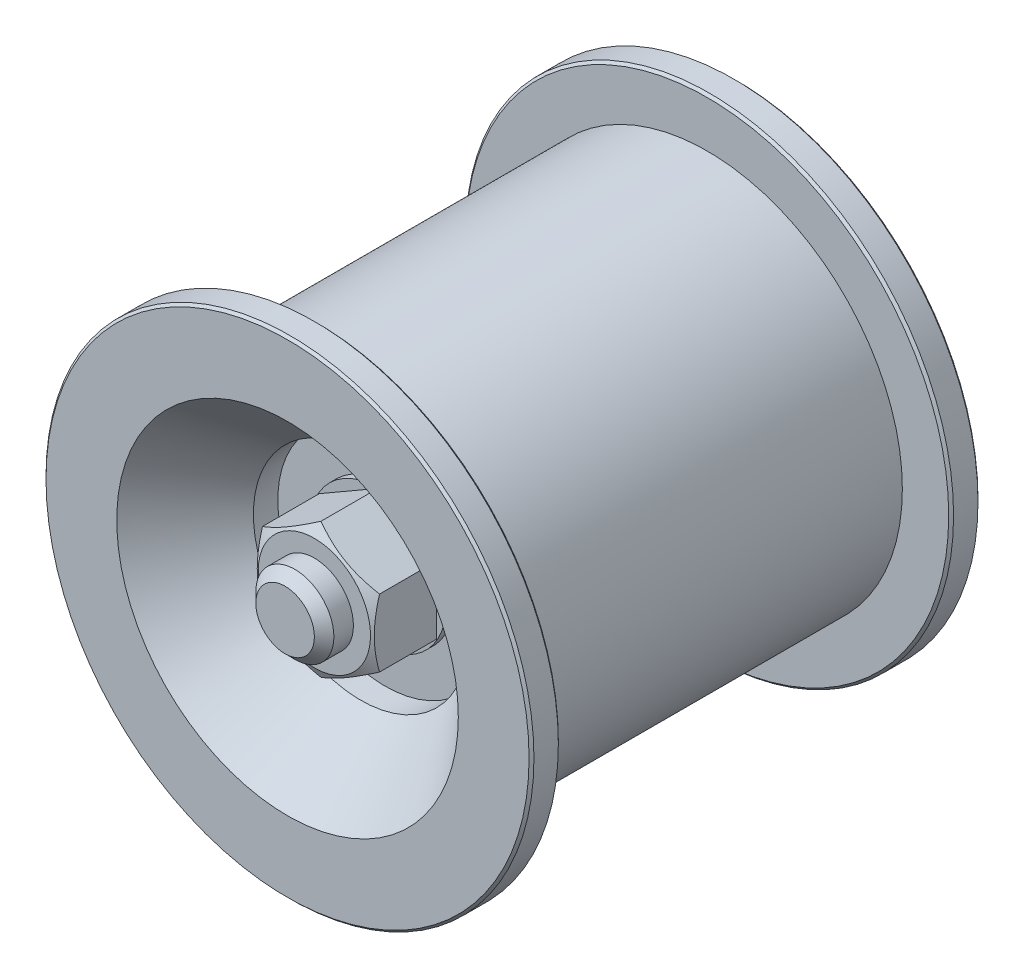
ISO-10303-21;
HEADER;
FILE_DESCRIPTION(('STEP AP214'),'2;1');
FILE_NAME('part.step','',(''),(''),'','','');
FILE_SCHEMA(('AUTOMOTIVE_DESIGN { 1 0 10303 214 1 1 1 1 }'));
ENDSEC;
DATA;
#1=APPLICATION_CONTEXT('core data for automotive mechanical design processes');
#2=APPLICATION_PROTOCOL_DEFINITION('international standard','automotive_design',2000,#1);
#3=PRODUCT_CONTEXT('',#1,'mechanical');
#4=PRODUCT('Part','Part','',(#3));
#5=PRODUCT_RELATED_PRODUCT_CATEGORY('part','',(#4));
#6=PRODUCT_DEFINITION_FORMATION('','',#4);
#7=PRODUCT_DEFINITION_CONTEXT('part definition',#1,'design');
#8=PRODUCT_DEFINITION('design','',#6,#7);
#9=PRODUCT_DEFINITION_SHAPE('','',#8);
#10=(LENGTH_UNIT() NAMED_UNIT(*) SI_UNIT(.MILLI.,.METRE.));
#11=(NAMED_UNIT(*) PLANE_ANGLE_UNIT() SI_UNIT($,.RADIAN.));
#12=(NAMED_UNIT(*) SI_UNIT($,.STERADIAN.) SOLID_ANGLE_UNIT());
#13=UNCERTAINTY_MEASURE_WITH_UNIT(LENGTH_MEASURE(1.E-05),#10,'distance_accuracy_value','');
#14=(GEOMETRIC_REPRESENTATION_CONTEXT(3) GLOBAL_UNCERTAINTY_ASSIGNED_CONTEXT((#13)) GLOBAL_UNIT_ASSIGNED_CONTEXT((#10,
#11,#12)) REPRESENTATION_CONTEXT('',''));
#15=CARTESIAN_POINT('',(0.,0.,0.));
#16=DIRECTION('',(0.,0.,1.));
#17=DIRECTION('',(1.,0.,0.));
#18=AXIS2_PLACEMENT_3D('',#15,#16,#17);
#19=CARTESIAN_POINT('',(0.,-10.,74.));
#20=DIRECTION('',(0.,0.,-1.));
#21=DIRECTION('',(1.,0.,0.));
#22=AXIS2_PLACEMENT_3D('',#19,#20,#21);
#23=PLANE('',#22);
#24=CARTESIAN_POINT('',(0.,0.,74.));
#25=DIRECTION('',(0.,0.,-1.));
#26=DIRECTION('',(1.,0.,0.));
#27=AXIS2_PLACEMENT_3D('',#24,#25,#26);
#28=CIRCLE('',#27,22.);
#29=CARTESIAN_POINT('',(22.,0.,74.));
#30=VERTEX_POINT('',#29);
#31=EDGE_CURVE('E151',#30,#30,#28,.T.);
#32=ORIENTED_EDGE('',*,*,#31,.F.);
#33=EDGE_LOOP('',(#32));
#34=FACE_BOUND('',#33,.T.);
#35=CARTESIAN_POINT('',(0.,0.,74.));
#36=DIRECTION('',(0.,0.,1.));
#37=DIRECTION('',(1.,0.,0.));
#38=AXIS2_PLACEMENT_3D('',#35,#36,#37);
#39=CIRCLE('',#38,14.);
#40=CARTESIAN_POINT('',(14.,0.,74.));
#41=VERTEX_POINT('',#40);
#42=EDGE_CURVE('E136',#41,#41,#39,.T.);
#43=ORIENTED_EDGE('',*,*,#42,.F.);
#44=EDGE_LOOP('',(#43));
#45=FACE_BOUND('',#44,.T.);
#46=ADVANCED_FACE('F15',(#34,#45),#23,.F.);
#47=CARTESIAN_POINT('',(0.,0.,28.0000000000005));
#48=DIRECTION('',(0.,0.,-1.));
#49=DIRECTION('',(1.,0.,0.));
#50=AXIS2_PLACEMENT_3D('',#47,#48,#49);
#51=CYLINDRICAL_SURFACE('',#50,22.);
#52=CARTESIAN_POINT('',(0.,0.,79.));
#53=DIRECTION('',(0.,0.,-1.));
#54=DIRECTION('',(1.,0.,0.));
#55=AXIS2_PLACEMENT_3D('',#52,#53,#54);
#56=CIRCLE('',#55,22.);
#57=CARTESIAN_POINT('',(22.,0.,79.));
#58=VERTEX_POINT('',#57);
#59=EDGE_CURVE('E205',#58,#58,#56,.T.);
#60=ORIENTED_EDGE('',*,*,#59,.F.);
#61=EDGE_LOOP('',(#60));
#62=FACE_BOUND('',#61,.T.);
#63=ORIENTED_EDGE('',*,*,#31,.T.);
#64=EDGE_LOOP('',(#63));
#65=FACE_BOUND('',#64,.T.);
#66=ADVANCED_FACE('F380',(#62,#65),#51,.F.);
#67=CARTESIAN_POINT('',(0.,0.,79.));
#68=DIRECTION('',(0.,0.,1.));
#69=DIRECTION('',(-1.,0.,0.));
#70=AXIS2_PLACEMENT_3D('',#67,#68,#69);
#71=CONICAL_SURFACE('',#70,22.,0.714090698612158);
#72=CARTESIAN_POINT('',(0.,0.,94.));
#73=DIRECTION('',(0.,0.,-1.));
#74=DIRECTION('',(1.,0.,0.));
#75=AXIS2_PLACEMENT_3D('',#72,#73,#74);
#76=CIRCLE('',#75,35.);
#77=CARTESIAN_POINT('',(35.,0.,94.));
#78=VERTEX_POINT('',#77);
#79=EDGE_CURVE('E202',#78,#78,#76,.T.);
#80=ORIENTED_EDGE('',*,*,#79,.F.);
#81=EDGE_LOOP('',(#80));
#82=FACE_BOUND('',#81,.T.);
#83=ORIENTED_EDGE('',*,*,#59,.T.);
#84=EDGE_LOOP('',(#83));
#85=FACE_BOUND('',#84,.T.);
#86=ADVANCED_FACE('F376',(#82,#85),#71,.F.);
#87=CARTESIAN_POINT('',(0.,-50.,94.));
#88=DIRECTION('',(0.,0.,1.));
#89=DIRECTION('',(-1.,0.,0.));
#90=AXIS2_PLACEMENT_3D('',#87,#88,#89);
#91=PLANE('',#90);
#92=CARTESIAN_POINT('',(0.,0.,94.));
#93=DIRECTION('',(0.,0.,1.));
#94=DIRECTION('',(1.,0.,0.));
#95=AXIS2_PLACEMENT_3D('',#92,#93,#94);
#96=CIRCLE('',#95,49.5);
#97=CARTESIAN_POINT('',(49.5,0.,94.));
#98=VERTEX_POINT('',#97);
#99=EDGE_CURVE('E23',#98,#98,#96,.T.);
#100=ORIENTED_EDGE('',*,*,#99,.T.);
#101=EDGE_LOOP('',(#100));
#102=FACE_BOUND('',#101,.T.);
#103=ORIENTED_EDGE('',*,*,#79,.T.);
#104=EDGE_LOOP('',(#103));
#105=FACE_BOUND('',#104,.T.);
#106=ADVANCED_FACE('F372',(#102,#105),#91,.T.);
#107=CARTESIAN_POINT('',(0.,0.,28.0000000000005));
#108=DIRECTION('',(0.,0.,-1.));
#109=DIRECTION('',(1.,0.,0.));
#110=AXIS2_PLACEMENT_3D('',#107,#108,#109);
#111=CYLINDRICAL_SURFACE('',#110,50.);
#112=CARTESIAN_POINT('',(0.,0.,93.5));
#113=DIRECTION('',(0.,0.,1.));
#114=DIRECTION('',(1.,0.,0.));
#115=AXIS2_PLACEMENT_3D('',#112,#113,#114);
#116=CIRCLE('',#115,50.);
#117=CARTESIAN_POINT('',(50.,0.,93.5));
#118=VERTEX_POINT('',#117);
#119=EDGE_CURVE('E422',#118,#118,#116,.F.);
#120=ORIENTED_EDGE('',*,*,#119,.T.);
#121=EDGE_LOOP('',(#120));
#122=FACE_BOUND('',#121,.T.);
#123=CARTESIAN_POINT('',(0.,0.,88.5));
#124=DIRECTION('',(0.,0.,1.));
#125=DIRECTION('',(1.,0.,0.));
#126=AXIS2_PLACEMENT_3D('',#123,#124,#125);
#127=CIRCLE('',#126,50.);
#128=CARTESIAN_POINT('',(50.,0.,88.5));
#129=VERTEX_POINT('',#128);
#130=EDGE_CURVE('E423',#129,#129,#127,.T.);
#131=ORIENTED_EDGE('',*,*,#130,.T.);
#132=EDGE_LOOP('',(#131));
#133=FACE_BOUND('',#132,.T.);
#134=ADVANCED_FACE('F368',(#122,#133),#111,.T.);
#135=CARTESIAN_POINT('',(0.,-50.,88.));
#136=DIRECTION('',(0.,0.,1.));
#137=DIRECTION('',(-1.,0.,0.));
#138=AXIS2_PLACEMENT_3D('',#135,#136,#137);
#139=PLANE('',#138);
#140=CARTESIAN_POINT('',(0.,0.,88.));
#141=DIRECTION('',(0.,0.,1.));
#142=DIRECTION('',(1.,0.,0.));
#143=AXIS2_PLACEMENT_3D('',#140,#141,#142);
#144=CIRCLE('',#143,49.5);
#145=CARTESIAN_POINT('',(49.5,0.,88.));
#146=VERTEX_POINT('',#145);
#147=EDGE_CURVE('E9',#146,#146,#144,.F.);
#148=ORIENTED_EDGE('',*,*,#147,.T.);
#149=EDGE_LOOP('',(#148));
#150=FACE_BOUND('',#149,.T.);
#151=CARTESIAN_POINT('',(0.,0.,88.));
#152=DIRECTION('',(0.,0.,-1.));
#153=DIRECTION('',(1.,0.,0.));
#154=AXIS2_PLACEMENT_3D('',#151,#152,#153);
#155=CIRCLE('',#154,40.);
#156=CARTESIAN_POINT('',(40.,0.,88.));
#157=VERTEX_POINT('',#156);
#158=EDGE_CURVE('E199',#157,#157,#155,.T.);
#159=ORIENTED_EDGE('',*,*,#158,.F.);
#160=EDGE_LOOP('',(#159));
#161=FACE_BOUND('',#160,.T.);
#162=ADVANCED_FACE('F364',(#150,#161),#139,.F.);
#163=CARTESIAN_POINT('',(0.,0.,28.0000000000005));
#164=DIRECTION('',(0.,0.,-1.));
#165=DIRECTION('',(1.,0.,0.));
#166=AXIS2_PLACEMENT_3D('',#163,#164,#165);
#167=CYLINDRICAL_SURFACE('',#166,40.);
#168=ORIENTED_EDGE('',*,*,#158,.T.);
#169=EDGE_LOOP('',(#168));
#170=FACE_BOUND('',#169,.T.);
#171=CARTESIAN_POINT('',(0.,0.,8.00000000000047));
#172=DIRECTION('',(0.,0.,-1.));
#173=DIRECTION('',(1.,0.,0.));
#174=AXIS2_PLACEMENT_3D('',#171,#172,#173);
#175=CIRCLE('',#174,40.);
#176=CARTESIAN_POINT('',(40.,0.,8.00000000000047));
#177=VERTEX_POINT('',#176);
#178=EDGE_CURVE('E196',#177,#177,#175,.T.);
#179=ORIENTED_EDGE('',*,*,#178,.F.);
#180=EDGE_LOOP('',(#179));
#181=FACE_BOUND('',#180,.T.);
#182=ADVANCED_FACE('F360',(#170,#181),#167,.T.);
#183=CARTESIAN_POINT('',(0.,-50.,8.00000000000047));
#184=DIRECTION('',(0.,0.,1.));
#185=DIRECTION('',(-1.,0.,0.));
#186=AXIS2_PLACEMENT_3D('',#183,#184,#185);
#187=PLANE('',#186);
#188=CARTESIAN_POINT('',(0.,0.,8.00000000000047));
#189=DIRECTION('',(0.,0.,1.));
#190=DIRECTION('',(1.,0.,0.));
#191=AXIS2_PLACEMENT_3D('',#188,#189,#190);
#192=CIRCLE('',#191,49.5);
#193=CARTESIAN_POINT('',(49.5,0.,8.00000000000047));
#194=VERTEX_POINT('',#193);
#195=EDGE_CURVE('E426',#194,#194,#192,.T.);
#196=ORIENTED_EDGE('',*,*,#195,.T.);
#197=EDGE_LOOP('',(#196));
#198=FACE_BOUND('',#197,.T.);
#199=ORIENTED_EDGE('',*,*,#178,.T.);
#200=EDGE_LOOP('',(#199));
#201=FACE_BOUND('',#200,.T.);
#202=ADVANCED_FACE('F356',(#198,#201),#187,.T.);
#203=CARTESIAN_POINT('',(0.,0.,28.0000000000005));
#204=DIRECTION('',(0.,0.,-1.));
#205=DIRECTION('',(1.,0.,0.));
#206=AXIS2_PLACEMENT_3D('',#203,#204,#205);
#207=CYLINDRICAL_SURFACE('',#206,50.);
#208=CARTESIAN_POINT('',(0.,0.,2.50000000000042));
#209=DIRECTION('',(0.,0.,1.));
#210=DIRECTION('',(1.,0.,0.));
#211=AXIS2_PLACEMENT_3D('',#208,#209,#210);
#212=CIRCLE('',#211,50.);
#213=CARTESIAN_POINT('',(50.,0.,2.50000000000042));
#214=VERTEX_POINT('',#213);
#215=EDGE_CURVE('E431',#214,#214,#212,.T.);
#216=ORIENTED_EDGE('',*,*,#215,.T.);
#217=EDGE_LOOP('',(#216));
#218=FACE_BOUND('',#217,.T.);
#219=CARTESIAN_POINT('',(0.,0.,7.50000000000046));
#220=DIRECTION('',(0.,0.,1.));
#221=DIRECTION('',(1.,0.,0.));
#222=AXIS2_PLACEMENT_3D('',#219,#220,#221);
#223=CIRCLE('',#222,50.);
#224=CARTESIAN_POINT('',(50.,0.,7.50000000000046));
#225=VERTEX_POINT('',#224);
#226=EDGE_CURVE('E433',#225,#225,#223,.F.);
#227=ORIENTED_EDGE('',*,*,#226,.T.);
#228=EDGE_LOOP('',(#227));
#229=FACE_BOUND('',#228,.T.);
#230=ADVANCED_FACE('F352',(#218,#229),#207,.T.);
#231=CARTESIAN_POINT('',(0.,-50.,2.00000000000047));
#232=DIRECTION('',(0.,0.,1.));
#233=DIRECTION('',(-1.,0.,0.));
#234=AXIS2_PLACEMENT_3D('',#231,#232,#233);
#235=PLANE('',#234);
#236=CARTESIAN_POINT('',(0.,0.,2.00000000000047));
#237=DIRECTION('',(0.,0.,1.));
#238=DIRECTION('',(1.,0.,0.));
#239=AXIS2_PLACEMENT_3D('',#236,#237,#238);
#240=CIRCLE('',#239,49.5);
#241=CARTESIAN_POINT('',(49.5,0.,2.00000000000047));
#242=VERTEX_POINT('',#241);
#243=EDGE_CURVE('E229',#242,#242,#240,.F.);
#244=ORIENTED_EDGE('',*,*,#243,.T.);
#245=EDGE_LOOP('',(#244));
#246=FACE_BOUND('',#245,.T.);
#247=CARTESIAN_POINT('',(0.,0.,2.00000000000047));
#248=DIRECTION('',(0.,0.,-1.));
#249=DIRECTION('',(1.,0.,0.));
#250=AXIS2_PLACEMENT_3D('',#247,#248,#249);
#251=CIRCLE('',#250,35.);
#252=CARTESIAN_POINT('',(35.,0.,2.00000000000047));
#253=VERTEX_POINT('',#252);
#254=EDGE_CURVE('E193',#253,#253,#251,.T.);
#255=ORIENTED_EDGE('',*,*,#254,.F.);
#256=EDGE_LOOP('',(#255));
#257=FACE_BOUND('',#256,.T.);
#258=ADVANCED_FACE('F348',(#246,#257),#235,.F.);
#259=CARTESIAN_POINT('',(0.,0.,17.0000000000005));
#260=DIRECTION('',(0.,0.,-1.));
#261=DIRECTION('',(1.,0.,0.));
#262=AXIS2_PLACEMENT_3D('',#259,#260,#261);
#263=CONICAL_SURFACE('',#262,22.,0.714090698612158);
#264=ORIENTED_EDGE('',*,*,#254,.T.);
#265=EDGE_LOOP('',(#264));
#266=FACE_BOUND('',#265,.T.);
#267=CARTESIAN_POINT('',(0.,0.,17.0000000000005));
#268=DIRECTION('',(0.,0.,-1.));
#269=DIRECTION('',(1.,0.,0.));
#270=AXIS2_PLACEMENT_3D('',#267,#268,#269);
#271=CIRCLE('',#270,22.);
#272=CARTESIAN_POINT('',(22.,0.,17.0000000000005));
#273=VERTEX_POINT('',#272);
#274=EDGE_CURVE('E189',#273,#273,#271,.T.);
#275=ORIENTED_EDGE('',*,*,#274,.F.);
#276=EDGE_LOOP('',(#275));
#277=FACE_BOUND('',#276,.T.);
#278=ADVANCED_FACE('F344',(#266,#277),#263,.F.);
#279=CARTESIAN_POINT('',(0.,0.,28.0000000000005));
#280=DIRECTION('',(0.,0.,-1.));
#281=DIRECTION('',(1.,0.,0.));
#282=AXIS2_PLACEMENT_3D('',#279,#280,#281);
#283=CYLINDRICAL_SURFACE('',#282,22.);
#284=ORIENTED_EDGE('',*,*,#274,.T.);
#285=EDGE_LOOP('',(#284));
#286=FACE_BOUND('',#285,.T.);
#287=CARTESIAN_POINT('',(0.,0.,22.0000000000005));
#288=DIRECTION('',(0.,0.,-1.));
#289=DIRECTION('',(1.,0.,0.));
#290=AXIS2_PLACEMENT_3D('',#287,#288,#289);
#291=CIRCLE('',#290,22.);
#292=CARTESIAN_POINT('',(22.,0.,22.0000000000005));
#293=VERTEX_POINT('',#292);
#294=EDGE_CURVE('E186',#293,#293,#291,.T.);
#295=ORIENTED_EDGE('',*,*,#294,.F.);
#296=EDGE_LOOP('',(#295));
#297=FACE_BOUND('',#296,.T.);
#298=ADVANCED_FACE('F341',(#286,#297),#283,.F.);
#299=CARTESIAN_POINT('',(0.,-10.,22.0000000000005));
#300=DIRECTION('',(0.,0.,-1.));
#301=DIRECTION('',(1.,0.,0.));
#302=AXIS2_PLACEMENT_3D('',#299,#300,#301);
#303=PLANE('',#302);
#304=DIRECTION('',(0.,-1.,0.));
#305=VECTOR('',#304,1.);
#306=CARTESIAN_POINT('',(11.,11.6189500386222,22.));
#307=LINE('',#306,#305);
#308=CARTESIAN_POINT('',(11.,11.6189500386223,22.));
#309=VERTEX_POINT('',#308);
#310=CARTESIAN_POINT('',(11.,-11.6189500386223,22.));
#311=VERTEX_POINT('',#310);
#312=EDGE_CURVE('E159',#309,#311,#307,.T.);
#313=ORIENTED_EDGE('',*,*,#312,.F.);
#314=CARTESIAN_POINT('',(0.,0.,22.));
#315=DIRECTION('',(0.,0.,1.));
#316=DIRECTION('',(1.,0.,0.));
#317=AXIS2_PLACEMENT_3D('',#314,#315,#316);
#318=CIRCLE('',#317,16.);
#319=CARTESIAN_POINT('',(-11.,11.6189500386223,22.));
#320=VERTEX_POINT('',#319);
#321=EDGE_CURVE('E181',#309,#320,#318,.T.);
#322=ORIENTED_EDGE('',*,*,#321,.T.);
#323=DIRECTION('',(0.,-1.,0.));
#324=VECTOR('',#323,1.);
#325=CARTESIAN_POINT('',(-11.,11.6189500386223,22.));
#326=LINE('',#325,#324);
#327=CARTESIAN_POINT('',(-11.,-11.6189500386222,22.));
#328=VERTEX_POINT('',#327);
#329=EDGE_CURVE('E148',#320,#328,#326,.T.);
#330=ORIENTED_EDGE('',*,*,#329,.T.);
#331=EDGE_CURVE('E74',#328,#311,#318,.T.);
#332=ORIENTED_EDGE('',*,*,#331,.T.);
#333=EDGE_LOOP('',(#313,#322,#330,#332));
#334=FACE_BOUND('',#333,.T.);
#335=ORIENTED_EDGE('',*,*,#294,.T.);
#336=EDGE_LOOP('',(#335));
#337=FACE_BOUND('',#336,.T.);
#338=ADVANCED_FACE('F312',(#334,#337),#303,.T.);
#339=CARTESIAN_POINT('',(11.,11.6189500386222,-22.5));
#340=DIRECTION('',(-1.,0.,0.));
#341=DIRECTION('',(0.,0.,1.));
#342=AXIS2_PLACEMENT_3D('',#339,#340,#341);
#343=PLANE('',#342);
#344=DIRECTION('',(0.,0.,1.));
#345=VECTOR('',#344,1.);
#346=CARTESIAN_POINT('',(11.,11.6189500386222,-22.5));
#347=LINE('',#346,#345);
#348=CARTESIAN_POINT('',(11.,11.6189500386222,0.));
#349=VERTEX_POINT('',#348);
#350=EDGE_CURVE('E161',#349,#309,#347,.T.);
#351=ORIENTED_EDGE('',*,*,#350,.T.);
#352=ORIENTED_EDGE('',*,*,#312,.T.);
#353=DIRECTION('',(0.,0.,1.));
#354=VECTOR('',#353,1.);
#355=CARTESIAN_POINT('',(11.,-11.6189500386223,-22.5));
#356=LINE('',#355,#354);
#357=CARTESIAN_POINT('',(11.,-11.6189500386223,0.));
#358=VERTEX_POINT('',#357);
#359=EDGE_CURVE('E164',#358,#311,#356,.T.);
#360=ORIENTED_EDGE('',*,*,#359,.F.);
#361=DIRECTION('',(0.,-1.,0.));
#362=VECTOR('',#361,1.);
#363=CARTESIAN_POINT('',(11.,0.,0.));
#364=LINE('',#363,#362);
#365=EDGE_CURVE('E166',#349,#358,#364,.T.);
#366=ORIENTED_EDGE('',*,*,#365,.F.);
#367=EDGE_LOOP('',(#351,#352,#360,#366));
#368=FACE_BOUND('',#367,.T.);
#369=ADVANCED_FACE('F309',(#368),#343,.F.);
#370=CARTESIAN_POINT('',(0.,0.,22.));
#371=DIRECTION('',(0.,0.,-1.));
#372=DIRECTION('',(-1.,0.,0.));
#373=AXIS2_PLACEMENT_3D('',#370,#371,#372);
#374=CYLINDRICAL_SURFACE('',#373,16.);
#375=DIRECTION('',(0.,0.,1.));
#376=VECTOR('',#375,1.);
#377=CARTESIAN_POINT('',(-11.,11.6189500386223,-22.5));
#378=LINE('',#377,#376);
#379=CARTESIAN_POINT('',(-11.,11.6189500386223,0.));
#380=VERTEX_POINT('',#379);
#381=EDGE_CURVE('E154',#380,#320,#378,.T.);
#382=ORIENTED_EDGE('',*,*,#381,.T.);
#383=ORIENTED_EDGE('',*,*,#321,.F.);
#384=ORIENTED_EDGE('',*,*,#350,.F.);
#385=CARTESIAN_POINT('',(0.,0.,0.));
#386=DIRECTION('',(0.,0.,1.));
#387=DIRECTION('',(1.,0.,0.));
#388=AXIS2_PLACEMENT_3D('',#385,#386,#387);
#389=CIRCLE('',#388,16.);
#390=EDGE_CURVE('E178',#349,#380,#389,.T.);
#391=ORIENTED_EDGE('',*,*,#390,.T.);
#392=EDGE_LOOP('',(#382,#383,#384,#391));
#393=FACE_BOUND('',#392,.T.);
#394=ADVANCED_FACE('F306',(#393),#374,.T.);
#395=CARTESIAN_POINT('',(-11.,11.6189500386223,-22.5));
#396=DIRECTION('',(-1.,0.,0.));
#397=DIRECTION('',(0.,-1.,0.));
#398=AXIS2_PLACEMENT_3D('',#395,#396,#397);
#399=PLANE('',#398);
#400=DIRECTION('',(0.,-1.,0.));
#401=VECTOR('',#400,1.);
#402=CARTESIAN_POINT('',(-11.,0.,0.));
#403=LINE('',#402,#401);
#404=CARTESIAN_POINT('',(-11.,-11.6189500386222,0.));
#405=VERTEX_POINT('',#404);
#406=EDGE_CURVE('E157',#380,#405,#403,.T.);
#407=ORIENTED_EDGE('',*,*,#406,.T.);
#408=DIRECTION('',(0.,0.,1.));
#409=VECTOR('',#408,1.);
#410=CARTESIAN_POINT('',(-11.,-11.6189500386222,-22.5));
#411=LINE('',#410,#409);
#412=EDGE_CURVE('E150',#405,#328,#411,.T.);
#413=ORIENTED_EDGE('',*,*,#412,.T.);
#414=ORIENTED_EDGE('',*,*,#329,.F.);
#415=ORIENTED_EDGE('',*,*,#381,.F.);
#416=EDGE_LOOP('',(#407,#413,#414,#415));
#417=FACE_BOUND('',#416,.T.);
#418=ADVANCED_FACE('F302',(#417),#399,.T.);
#419=ORIENTED_EDGE('',*,*,#412,.F.);
#420=EDGE_CURVE('E177',#405,#358,#389,.T.);
#421=ORIENTED_EDGE('',*,*,#420,.T.);
#422=ORIENTED_EDGE('',*,*,#359,.T.);
#423=ORIENTED_EDGE('',*,*,#331,.F.);
#424=EDGE_LOOP('',(#419,#421,#422,#423));
#425=FACE_BOUND('',#424,.T.);
#426=ADVANCED_FACE('F305',(#425),#374,.T.);
#427=CARTESIAN_POINT('',(0.,0.,0.));
#428=DIRECTION('',(0.,0.,1.));
#429=DIRECTION('',(1.,0.,0.));
#430=AXIS2_PLACEMENT_3D('',#427,#428,#429);
#431=PLANE('',#430);
#432=CARTESIAN_POINT('',(0.,0.,0.));
#433=DIRECTION('',(0.,0.,1.));
#434=DIRECTION('',(1.,0.,0.));
#435=AXIS2_PLACEMENT_3D('',#432,#433,#434);
#436=CIRCLE('',#435,10.);
#437=CARTESIAN_POINT('',(10.,0.,0.));
#438=VERTEX_POINT('',#437);
#439=EDGE_CURVE('E174',#438,#438,#436,.T.);
#440=ORIENTED_EDGE('',*,*,#439,.T.);
#441=EDGE_LOOP('',(#440));
#442=FACE_BOUND('',#441,.T.);
#443=ORIENTED_EDGE('',*,*,#406,.F.);
#444=ORIENTED_EDGE('',*,*,#390,.F.);
#445=ORIENTED_EDGE('',*,*,#365,.T.);
#446=ORIENTED_EDGE('',*,*,#420,.F.);
#447=EDGE_LOOP('',(#443,#444,#445,#446));
#448=FACE_BOUND('',#447,.T.);
#449=ADVANCED_FACE('F308',(#442,#448),#431,.F.);
#450=CARTESIAN_POINT('',(0.,0.,0.));
#451=DIRECTION('',(0.,0.,-1.));
#452=DIRECTION('',(-1.,0.,0.));
#453=AXIS2_PLACEMENT_3D('',#450,#451,#452);
#454=CYLINDRICAL_SURFACE('',#453,10.);
#455=CARTESIAN_POINT('',(0.,0.,-20.));
#456=DIRECTION('',(0.,0.,1.));
#457=DIRECTION('',(1.,0.,0.));
#458=AXIS2_PLACEMENT_3D('',#455,#456,#457);
#459=CIRCLE('',#458,10.);
#460=CARTESIAN_POINT('',(10.,0.,-20.));
#461=VERTEX_POINT('',#460);
#462=EDGE_CURVE('E147',#461,#461,#459,.T.);
#463=ORIENTED_EDGE('',*,*,#462,.T.);
#464=EDGE_LOOP('',(#463));
#465=FACE_BOUND('',#464,.T.);
#466=ORIENTED_EDGE('',*,*,#439,.F.);
#467=EDGE_LOOP('',(#466));
#468=FACE_BOUND('',#467,.T.);
#469=ADVANCED_FACE('F329',(#465,#468),#454,.T.);
#470=CARTESIAN_POINT('',(0.,0.,-22.5));
#471=DIRECTION('',(0.,0.,1.));
#472=DIRECTION('',(1.,0.,0.));
#473=AXIS2_PLACEMENT_3D('',#470,#471,#472);
#474=PLANE('',#473);
#475=CARTESIAN_POINT('',(0.,0.,-22.5));
#476=DIRECTION('',(0.,0.,1.));
#477=DIRECTION('',(1.,0.,0.));
#478=AXIS2_PLACEMENT_3D('',#475,#476,#477);
#479=CIRCLE('',#478,7.5);
#480=CARTESIAN_POINT('',(7.5,0.,-22.5));
#481=VERTEX_POINT('',#480);
#482=EDGE_CURVE('E212',#481,#481,#479,.F.);
#483=ORIENTED_EDGE('',*,*,#482,.T.);
#484=EDGE_LOOP('',(#483));
#485=FACE_BOUND('',#484,.T.);
#486=ADVANCED_FACE('F334',(#485),#474,.F.);
#487=CARTESIAN_POINT('',(11.9944518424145,6.925,88.5));
#488=DIRECTION('',(-0.5,-0.866025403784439,0.));
#489=DIRECTION('',(0.866025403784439,-0.5,0.));
#490=AXIS2_PLACEMENT_3D('',#487,#488,#489);
#491=PLANE('',#490);
#492=DIRECTION('',(0.,0.,-1.));
#493=VECTOR('',#492,1.);
#494=CARTESIAN_POINT('',(0.,13.85,88.5));
#495=LINE('',#494,#493);
#496=CARTESIAN_POINT('',(0.,13.85,87.1432268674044));
#497=VERTEX_POINT('',#496);
#498=CARTESIAN_POINT('',(0.,13.85,75.5));
#499=VERTEX_POINT('',#498);
#500=EDGE_CURVE('E130',#497,#499,#495,.T.);
#501=ORIENTED_EDGE('',*,*,#500,.F.);
#502=CARTESIAN_POINT('',(-0.0002,13.8501154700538,87.143160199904));
#503=CARTESIAN_POINT('',(0.263463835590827,13.6978890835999,87.2310333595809));
#504=CARTESIAN_POINT('',(0.52811074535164,13.5450951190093,87.3149181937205));
#505=CARTESIAN_POINT('',(1.05952683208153,13.2382818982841,87.4736045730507));
#506=CARTESIAN_POINT('',(1.32629667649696,13.0842622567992,87.548403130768));
#507=CARTESIAN_POINT('',(2.13090464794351,12.6197216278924,87.7577218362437));
#508=CARTESIAN_POINT('',(2.67191906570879,12.3073668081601,87.876781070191));
#509=CARTESIAN_POINT('',(3.4815223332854,11.839942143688,88.0163886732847));
#510=CARTESIAN_POINT('',(3.74769248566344,11.6862687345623,88.0561575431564));
#511=CARTESIAN_POINT('',(4.2812651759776,11.3782103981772,88.1228471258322));
#512=CARTESIAN_POINT('',(4.54866773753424,11.2238254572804,88.1497675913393));
#513=CARTESIAN_POINT('',(5.0839186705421,10.9147981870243,88.1900708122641));
#514=CARTESIAN_POINT('',(5.35176613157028,10.760156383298,88.203469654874));
#515=CARTESIAN_POINT('',(5.8877092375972,10.450729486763,88.2164441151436));
#516=CARTESIAN_POINT('',(6.15580487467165,10.2959443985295,88.2160201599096));
#517=CARTESIAN_POINT('',(6.657010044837,10.0065734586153,88.2023137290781));
#518=CARTESIAN_POINT('',(6.89015532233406,9.87196696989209,88.1907031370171));
#519=CARTESIAN_POINT('',(7.35590964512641,9.60306358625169,88.1572465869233));
#520=CARTESIAN_POINT('',(7.58851865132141,9.46876671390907,88.1353999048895));
#521=CARTESIAN_POINT('',(8.05307401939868,9.20055554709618,88.0818520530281));
#522=CARTESIAN_POINT('',(8.28501967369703,9.06664166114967,88.050142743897));
#523=CARTESIAN_POINT('',(8.74782356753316,8.79944170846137,87.9774259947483));
#524=CARTESIAN_POINT('',(8.97868173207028,8.66615568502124,87.9364179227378));
#525=CARTESIAN_POINT('',(9.6794646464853,8.26155848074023,87.7984089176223));
#526=CARTESIAN_POINT('',(10.1473600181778,7.99141896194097,87.6876469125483));
#527=CARTESIAN_POINT('',(11.076173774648,7.4551680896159,87.4362623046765));
#528=CARTESIAN_POINT('',(11.537104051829,7.18904987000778,87.2956987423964));
#529=CARTESIAN_POINT('',(11.9946518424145,6.92488452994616,87.143160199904));
#530=B_SPLINE_CURVE_WITH_KNOTS('',3,(#502,#503,#504,#505,#506,#507,#508,#509,#510,#511,#512,
#513,#514,#515,#516,#517,#518,#519,#520,#521,#522,#523,#524,#525,#526,#527,#528,#529),
.UNSPECIFIED.,.F.,.F.,(4,2,2,2,2,2,2,2,2,2,2,2,2,4),(0.,0.950565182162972,1.90144205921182,
3.80724359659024,4.73675449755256,5.66628328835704,6.5947048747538,7.5230977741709,
8.33129276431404,9.13954492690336,9.94846589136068,10.7574418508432,12.4109696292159,
14.0612516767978),.UNSPECIFIED.);
#531=CARTESIAN_POINT('',(11.9944518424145,6.925,87.1432268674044));
#532=VERTEX_POINT('',#531);
#533=EDGE_CURVE('E190',#497,#532,#530,.T.);
#534=ORIENTED_EDGE('',*,*,#533,.T.);
#535=DIRECTION('',(0.,0.,-1.));
#536=VECTOR('',#535,1.);
#537=CARTESIAN_POINT('',(11.9944518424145,6.925,88.5));
#538=LINE('',#537,#536);
#539=CARTESIAN_POINT('',(11.9944518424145,6.925,75.5));
#540=VERTEX_POINT('',#539);
#541=EDGE_CURVE('E39',#532,#540,#538,.T.);
#542=ORIENTED_EDGE('',*,*,#541,.T.);
#543=DIRECTION('',(-0.866025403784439,0.5,0.));
#544=VECTOR('',#543,1.);
#545=CARTESIAN_POINT('',(11.9944518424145,6.925,75.5));
#546=LINE('',#545,#544);
#547=EDGE_CURVE('E756',#540,#499,#546,.T.);
#548=ORIENTED_EDGE('',*,*,#547,.T.);
#549=EDGE_LOOP('',(#501,#534,#542,#548));
#550=FACE_BOUND('',#549,.T.);
#551=ADVANCED_FACE('F241',(#550),#491,.F.);
#552=CARTESIAN_POINT('',(0.,13.85,88.5));
#553=DIRECTION('',(0.5,-0.866025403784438,0.));
#554=DIRECTION('',(0.866025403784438,0.5,0.));
#555=AXIS2_PLACEMENT_3D('',#552,#553,#554);
#556=PLANE('',#555);
#557=DIRECTION('',(0.,0.,-1.));
#558=VECTOR('',#557,1.);
#559=CARTESIAN_POINT('',(-11.9944518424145,6.925,88.5));
#560=LINE('',#559,#558);
#561=CARTESIAN_POINT('',(-11.9944518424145,6.925,87.1432268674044));
#562=VERTEX_POINT('',#561);
#563=CARTESIAN_POINT('',(-11.9944518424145,6.925,75.5));
#564=VERTEX_POINT('',#563);
#565=EDGE_CURVE('E83',#562,#564,#560,.T.);
#566=ORIENTED_EDGE('',*,*,#565,.F.);
#567=CARTESIAN_POINT('',(-11.9946518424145,6.92488452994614,87.143160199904));
#568=CARTESIAN_POINT('',(-11.7309880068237,7.07711091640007,87.2310333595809));
#569=CARTESIAN_POINT('',(-11.4663410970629,7.22990488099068,87.3149181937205));
#570=CARTESIAN_POINT('',(-10.934925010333,7.53671810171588,87.4736045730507));
#571=CARTESIAN_POINT('',(-10.6681551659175,7.69073774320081,87.548403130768));
#572=CARTESIAN_POINT('',(-9.86354719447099,8.15527837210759,87.7577218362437));
#573=CARTESIAN_POINT('',(-9.32253277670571,8.46763319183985,87.876781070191));
#574=CARTESIAN_POINT('',(-8.51292950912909,8.935057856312,88.0163886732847));
#575=CARTESIAN_POINT('',(-8.24675935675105,9.08873126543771,88.0561575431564));
#576=CARTESIAN_POINT('',(-7.71318666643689,9.39678960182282,88.1228471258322));
#577=CARTESIAN_POINT('',(-7.44578410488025,9.55117454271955,88.1497675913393));
#578=CARTESIAN_POINT('',(-6.91053317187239,9.86020181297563,88.1900708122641));
#579=CARTESIAN_POINT('',(-6.6426857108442,10.014843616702,88.203469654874));
#580=CARTESIAN_POINT('',(-6.10674260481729,10.324270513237,88.2164441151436));
#581=CARTESIAN_POINT('',(-5.83864696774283,10.4790556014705,88.2160201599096));
#582=CARTESIAN_POINT('',(-5.33744179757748,10.7684265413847,88.2023137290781));
#583=CARTESIAN_POINT('',(-5.10429652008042,10.9030330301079,88.1907031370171));
#584=CARTESIAN_POINT('',(-4.63854219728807,11.1719364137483,88.1572465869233));
#585=CARTESIAN_POINT('',(-4.40593319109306,11.3062332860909,88.1353999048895));
#586=CARTESIAN_POINT('',(-3.9413778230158,11.5744444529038,88.0818520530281));
#587=CARTESIAN_POINT('',(-3.70943216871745,11.7083583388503,88.050142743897));
#588=CARTESIAN_POINT('',(-3.24662827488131,11.9755582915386,87.9774259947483));
#589=CARTESIAN_POINT('',(-3.01577011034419,12.1088443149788,87.9364179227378));
#590=CARTESIAN_POINT('',(-2.31498719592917,12.5134415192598,87.7984089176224));
#591=CARTESIAN_POINT('',(-1.84709182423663,12.783581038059,87.6876469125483));
#592=CARTESIAN_POINT('',(-0.918278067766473,13.3198319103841,87.4362623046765));
#593=CARTESIAN_POINT('',(-0.45734779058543,13.5859501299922,87.2956987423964));
#594=CARTESIAN_POINT('',(0.000200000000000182,13.8501154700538,87.143160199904));
#595=B_SPLINE_CURVE_WITH_KNOTS('',3,(#567,#568,#569,#570,#571,#572,#573,#574,#575,#576,#577,
#578,#579,#580,#581,#582,#583,#584,#585,#586,#587,#588,#589,#590,#591,#592,#593,#594),
.UNSPECIFIED.,.F.,.F.,(4,2,2,2,2,2,2,2,2,2,2,2,2,4),(0.,0.950565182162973,1.90144205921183,
3.80724359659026,4.73675449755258,5.66628328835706,6.59470487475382,7.52309777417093,
8.33129276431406,9.13954492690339,9.94846589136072,10.7574418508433,12.410969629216,
14.0612516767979),.UNSPECIFIED.);
#596=EDGE_CURVE('E269',#562,#497,#595,.T.);
#597=ORIENTED_EDGE('',*,*,#596,.T.);
#598=ORIENTED_EDGE('',*,*,#500,.T.);
#599=DIRECTION('',(-0.866025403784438,-0.5,0.));
#600=VECTOR('',#599,1.);
#601=CARTESIAN_POINT('',(0.,13.85,75.5));
#602=LINE('',#601,#600);
#603=EDGE_CURVE('E121',#499,#564,#602,.T.);
#604=ORIENTED_EDGE('',*,*,#603,.T.);
#605=EDGE_LOOP('',(#566,#597,#598,#604));
#606=FACE_BOUND('',#605,.T.);
#607=ADVANCED_FACE('F279',(#606),#556,.F.);
#608=CARTESIAN_POINT('',(-11.9944518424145,6.925,88.5));
#609=DIRECTION('',(1.,0.,0.));
#610=DIRECTION('',(0.,0.,-1.));
#611=AXIS2_PLACEMENT_3D('',#608,#609,#610);
#612=PLANE('',#611);
#613=DIRECTION('',(0.,0.,-1.));
#614=VECTOR('',#613,1.);
#615=CARTESIAN_POINT('',(-11.9944518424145,-6.925,88.5));
#616=LINE('',#615,#614);
#617=CARTESIAN_POINT('',(-11.9944518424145,-6.925,87.1432268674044));
#618=VERTEX_POINT('',#617);
#619=CARTESIAN_POINT('',(-11.9944518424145,-6.925,75.5));
#620=VERTEX_POINT('',#619);
#621=EDGE_CURVE('E105',#618,#620,#616,.T.);
#622=ORIENTED_EDGE('',*,*,#621,.F.);
#623=CARTESIAN_POINT('',(-11.9944518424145,-18.7218551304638,82.3024108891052));
#624=CARTESIAN_POINT('',(-11.9944518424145,-18.4594129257,82.429991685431));
#625=CARTESIAN_POINT('',(-11.9944518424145,-18.196665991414,82.556945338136));
#626=CARTESIAN_POINT('',(-11.9944518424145,-17.6704991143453,82.8094565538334));
#627=CARTESIAN_POINT('',(-11.9944518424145,-17.4070791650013,82.9350141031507));
#628=CARTESIAN_POINT('',(-11.9944518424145,-16.6156459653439,83.3094122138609));
#629=CARTESIAN_POINT('',(-11.9944518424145,-16.0865351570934,83.5559412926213));
#630=CARTESIAN_POINT('',(-11.9944518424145,-15.0219906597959,84.0426690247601));
#631=CARTESIAN_POINT('',(-11.9944518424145,-14.4865383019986,84.2828269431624));
#632=CARTESIAN_POINT('',(-11.9944518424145,-13.4114172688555,84.7534781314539));
#633=CARTESIAN_POINT('',(-11.9944518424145,-12.8717487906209,84.9839718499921));
#634=CARTESIAN_POINT('',(-11.9944518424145,-11.7694679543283,85.4401361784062));
#635=CARTESIAN_POINT('',(-11.9944518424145,-11.206685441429,85.6653977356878));
#636=CARTESIAN_POINT('',(-11.9944518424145,-10.0745769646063,86.099162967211));
#637=CARTESIAN_POINT('',(-11.9944518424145,-9.5052502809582,86.3076647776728));
#638=CARTESIAN_POINT('',(-11.9944518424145,-8.36019316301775,86.7025218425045));
#639=CARTESIAN_POINT('',(-11.9944518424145,-7.78447795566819,86.8889209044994));
#640=CARTESIAN_POINT('',(-11.9944518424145,-6.62473572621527,87.233682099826));
#641=CARTESIAN_POINT('',(-11.9944518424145,-6.04071134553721,87.3920529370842));
#642=CARTESIAN_POINT('',(-11.9944518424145,-5.15995045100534,87.6024831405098));
#643=CARTESIAN_POINT('',(-11.9944518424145,-4.86640107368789,87.6679603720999));
#644=CARTESIAN_POINT('',(-11.9944518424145,-4.27727440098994,87.7891042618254));
#645=CARTESIAN_POINT('',(-11.9944518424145,-3.98169714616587,87.8447711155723));
#646=CARTESIAN_POINT('',(-11.9944518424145,-3.38870993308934,87.9453191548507));
#647=CARTESIAN_POINT('',(-11.9944518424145,-3.09130000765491,87.9902005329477));
#648=CARTESIAN_POINT('',(-11.9944518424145,-2.4949524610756,88.0682870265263));
#649=CARTESIAN_POINT('',(-11.9944518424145,-2.19601490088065,88.101492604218));
#650=CARTESIAN_POINT('',(-11.9944518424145,-1.60098604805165,88.1551446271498));
#651=CARTESIAN_POINT('',(-11.9944518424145,-1.3049095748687,88.1757544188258));
#652=CARTESIAN_POINT('',(-11.9944518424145,-0.712150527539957,88.2044285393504));
#653=CARTESIAN_POINT('',(-11.9944518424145,-0.415467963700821,88.2124930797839));
#654=CARTESIAN_POINT('',(-11.9944518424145,0.177973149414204,88.2158843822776));
#655=CARTESIAN_POINT('',(-11.9944518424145,0.474731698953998,88.2112110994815));
#656=CARTESIAN_POINT('',(-11.9944518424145,1.06778454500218,88.1892421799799));
#657=CARTESIAN_POINT('',(-11.9944518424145,1.36407882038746,88.171945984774));
#658=CARTESIAN_POINT('',(-11.9944518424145,2.07252202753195,88.1158696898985));
#659=CARTESIAN_POINT('',(-11.9944518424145,2.48422124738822,88.0713032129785));
#660=CARTESIAN_POINT('',(-11.9944518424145,3.30464577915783,87.9601978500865));
#661=CARTESIAN_POINT('',(-11.9944518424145,3.71337069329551,87.893656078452));
#662=CARTESIAN_POINT('',(-11.9944518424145,4.527428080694,87.7409669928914));
#663=CARTESIAN_POINT('',(-11.9944518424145,4.93275773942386,87.6548048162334));
#664=CARTESIAN_POINT('',(-11.9944518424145,5.73939154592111,87.4655105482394));
#665=CARTESIAN_POINT('',(-11.9944518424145,6.14069574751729,87.3623786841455));
#666=CARTESIAN_POINT('',(-11.9944518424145,6.94823590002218,87.139187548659));
#667=CARTESIAN_POINT('',(-11.9944518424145,7.35438063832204,87.0188005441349));
#668=CARTESIAN_POINT('',(-11.9944518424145,8.16267065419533,86.7653434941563));
#669=CARTESIAN_POINT('',(-11.9944518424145,8.56481590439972,86.6322733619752));
#670=CARTESIAN_POINT('',(-11.9944518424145,9.36530216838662,86.3555843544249));
#671=CARTESIAN_POINT('',(-11.9944518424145,9.76364433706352,86.2119688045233));
#672=CARTESIAN_POINT('',(-11.9944518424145,10.5570108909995,85.9159025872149));
#673=CARTESIAN_POINT('',(-11.9944518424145,10.9520353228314,85.7634520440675));
#674=CARTESIAN_POINT('',(-11.9944518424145,11.913701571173,85.3819238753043));
#675=CARTESIAN_POINT('',(-11.9944518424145,12.4787553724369,85.148848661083));
#676=CARTESIAN_POINT('',(-11.9944518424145,13.6038043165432,84.6707564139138));
#677=CARTESIAN_POINT('',(-11.9944518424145,14.1637990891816,84.4257385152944));
#678=CARTESIAN_POINT('',(-11.9944518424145,15.2797216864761,83.9262536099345));
#679=CARTESIAN_POINT('',(-11.9944518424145,15.8356484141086,83.6717841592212));
#680=CARTESIAN_POINT('',(-11.9944518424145,16.9439999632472,83.1553861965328));
#681=CARTESIAN_POINT('',(-11.9944518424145,17.496424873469,82.8934578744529));
#682=CARTESIAN_POINT('',(-11.9944518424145,18.5990525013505,82.3632683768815));
#683=CARTESIAN_POINT('',(-11.9944518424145,19.1492516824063,82.0949998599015));
#684=CARTESIAN_POINT('',(-11.9944518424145,20.2472311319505,81.5535577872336));
#685=CARTESIAN_POINT('',(-11.9944518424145,20.7950113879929,81.2803842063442));
#686=CARTESIAN_POINT('',(-11.9944518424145,21.8884570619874,80.7300440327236));
#687=CARTESIAN_POINT('',(-11.9944518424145,22.4341227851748,80.4528780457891));
#688=CARTESIAN_POINT('',(-11.9944518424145,23.5237368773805,79.8951888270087));
#689=CARTESIAN_POINT('',(-11.9944518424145,24.067685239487,79.6146655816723));
#690=CARTESIAN_POINT('',(-11.9944518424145,25.6006418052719,78.8190804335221));
#691=CARTESIAN_POINT('',(-11.9944518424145,26.5879626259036,78.3007674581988));
#692=CARTESIAN_POINT('',(-11.9944518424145,28.5589924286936,77.2572377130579));
#693=CARTESIAN_POINT('',(-11.9944518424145,29.5427012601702,76.7320206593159));
#694=CARTESIAN_POINT('',(-11.9944518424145,31.5046220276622,75.6777728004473));
#695=CARTESIAN_POINT('',(-11.9944518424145,32.4828416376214,75.1487562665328));
#696=CARTESIAN_POINT('',(-11.9944518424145,33.9484822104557,74.352197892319));
#697=CARTESIAN_POINT('',(-11.9944518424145,34.4367330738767,74.0861808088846));
#698=CARTESIAN_POINT('',(-11.9944518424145,35.4127376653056,73.5532378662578));
#699=CARTESIAN_POINT('',(-11.9944518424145,35.9004913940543,73.2863120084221));
#700=CARTESIAN_POINT('',(-11.9944518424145,36.3880253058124,73.0189851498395));
#701=B_SPLINE_CURVE_WITH_KNOTS('',3,(#623,#624,#625,#626,#627,#628,#629,#630,#631,#632,#633,
#634,#635,#636,#637,#638,#639,#640,#641,#642,#643,#644,#645,#646,#647,#648,#649,#650,#651,#652,
#653,#654,#655,#656,#657,#658,#659,#660,#661,#662,#663,#664,#665,#666,#667,#668,#669,#670,#671,
#672,#673,#674,#675,#676,#677,#678,#679,#680,#681,#682,#683,#684,#685,#686,#687,#688,#689,#690,
#691,#692,#693,#694,#695,#696,#697,#698,#699,#700),.UNSPECIFIED.,.F.,.F.,(4,2,2,2,2,2,2,2,2,2,2,
2,2,2,2,2,2,2,2,2,2,2,2,2,2,2,2,2,2,2,2,2,2,2,2,2,2,2,4),(0.,0.875426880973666,1.75086232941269,
3.50198616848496,5.2624415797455,7.02281517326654,8.84118283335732,10.6597524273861,
12.4746551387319,14.288993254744,15.1911454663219,16.0932796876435,16.9953978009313,
17.8974801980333,18.7876010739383,19.6777069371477,20.5678159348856,21.4579643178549,
22.699593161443,23.9413851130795,25.1841208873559,26.4268400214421,27.6974270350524,
28.9680227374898,30.2382194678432,31.5083983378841,33.3419163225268,35.175567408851,
37.0096959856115,38.8437779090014,40.6800991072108,42.5164297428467,44.3524846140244,
46.188546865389,49.5338088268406,52.8792087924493,56.2155032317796,57.8835510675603,
59.5515964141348),.UNSPECIFIED.);
#702=EDGE_CURVE('E263',#618,#562,#701,.T.);
#703=ORIENTED_EDGE('',*,*,#702,.T.);
#704=ORIENTED_EDGE('',*,*,#565,.T.);
#705=DIRECTION('',(0.,-1.,0.));
#706=VECTOR('',#705,1.);
#707=CARTESIAN_POINT('',(-11.9944518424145,6.925,75.5));
#708=LINE('',#707,#706);
#709=EDGE_CURVE('E119',#564,#620,#708,.T.);
#710=ORIENTED_EDGE('',*,*,#709,.T.);
#711=EDGE_LOOP('',(#622,#703,#704,#710));
#712=FACE_BOUND('',#711,.T.);
#713=ADVANCED_FACE('F276',(#712),#612,.F.);
#714=CARTESIAN_POINT('',(-11.9944518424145,-6.925,88.5));
#715=DIRECTION('',(0.5,0.866025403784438,0.));
#716=DIRECTION('',(-0.866025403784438,0.5,0.));
#717=AXIS2_PLACEMENT_3D('',#714,#715,#716);
#718=PLANE('',#717);
#719=DIRECTION('',(0.,0.,-1.));
#720=VECTOR('',#719,1.);
#721=CARTESIAN_POINT('',(0.,-13.85,88.5));
#722=LINE('',#721,#720);
#723=CARTESIAN_POINT('',(0.,-13.85,87.1432268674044));
#724=VERTEX_POINT('',#723);
#725=CARTESIAN_POINT('',(0.,-13.85,75.5));
#726=VERTEX_POINT('',#725);
#727=EDGE_CURVE('E96',#724,#726,#722,.T.);
#728=ORIENTED_EDGE('',*,*,#727,.F.);
#729=CARTESIAN_POINT('',(0.000200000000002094,-13.8501154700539,87.143160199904));
#730=CARTESIAN_POINT('',(-0.263463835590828,-13.6978890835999,87.2310333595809));
#731=CARTESIAN_POINT('',(-0.528110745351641,-13.5450951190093,87.3149181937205));
#732=CARTESIAN_POINT('',(-1.05952683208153,-13.2382818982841,87.4736045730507));
#733=CARTESIAN_POINT('',(-1.32629667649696,-13.0842622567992,87.548403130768));
#734=CARTESIAN_POINT('',(-2.13090464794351,-12.6197216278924,87.7577218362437));
#735=CARTESIAN_POINT('',(-2.67191906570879,-12.3073668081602,87.876781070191));
#736=CARTESIAN_POINT('',(-3.48152233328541,-11.839942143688,88.0163886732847));
#737=CARTESIAN_POINT('',(-3.74769248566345,-11.6862687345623,88.0561575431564));
#738=CARTESIAN_POINT('',(-4.28126517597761,-11.3782103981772,88.1228471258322));
#739=CARTESIAN_POINT('',(-4.54866773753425,-11.2238254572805,88.1497675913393));
#740=CARTESIAN_POINT('',(-5.08391867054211,-10.9147981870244,88.1900708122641));
#741=CARTESIAN_POINT('',(-5.3517661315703,-10.760156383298,88.203469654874));
#742=CARTESIAN_POINT('',(-5.88770923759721,-10.450729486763,88.2164441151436));
#743=CARTESIAN_POINT('',(-6.15580487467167,-10.2959443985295,88.2160201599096));
#744=CARTESIAN_POINT('',(-6.65701004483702,-10.0065734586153,88.2023137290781));
#745=CARTESIAN_POINT('',(-6.89015532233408,-9.8719669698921,88.1907031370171));
#746=CARTESIAN_POINT('',(-7.35590964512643,-9.60306358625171,88.1572465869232));
#747=CARTESIAN_POINT('',(-7.58851865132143,-9.46876671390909,88.1353999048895));
#748=CARTESIAN_POINT('',(-8.0530740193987,-9.2005555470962,88.0818520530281));
#749=CARTESIAN_POINT('',(-8.28501967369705,-9.06664166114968,88.050142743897));
#750=CARTESIAN_POINT('',(-8.74782356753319,-8.79944170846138,87.9774259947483));
#751=CARTESIAN_POINT('',(-8.97868173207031,-8.66615568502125,87.9364179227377));
#752=CARTESIAN_POINT('',(-9.67946464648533,-8.26155848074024,87.7984089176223));
#753=CARTESIAN_POINT('',(-10.1473600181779,-7.99141896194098,87.6876469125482));
#754=CARTESIAN_POINT('',(-11.076173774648,-7.4551680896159,87.4362623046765));
#755=CARTESIAN_POINT('',(-11.5371040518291,-7.18904987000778,87.2956987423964));
#756=CARTESIAN_POINT('',(-11.9946518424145,-6.92488452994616,87.143160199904));
#757=B_SPLINE_CURVE_WITH_KNOTS('',3,(#729,#730,#731,#732,#733,#734,#735,#736,#737,#738,#739,
#740,#741,#742,#743,#744,#745,#746,#747,#748,#749,#750,#751,#752,#753,#754,#755,#756),
.UNSPECIFIED.,.F.,.F.,(4,2,2,2,2,2,2,2,2,2,2,2,2,4),(0.,0.950565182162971,1.90144205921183,
3.80724359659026,4.73675449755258,5.66628328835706,6.59470487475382,7.52309777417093,
8.33129276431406,9.13954492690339,9.94846589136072,10.7574418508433,12.410969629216,
14.0612516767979),.UNSPECIFIED.);
#758=EDGE_CURVE('E256',#724,#618,#757,.T.);
#759=ORIENTED_EDGE('',*,*,#758,.T.);
#760=ORIENTED_EDGE('',*,*,#621,.T.);
#761=DIRECTION('',(0.866025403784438,-0.5,0.));
#762=VECTOR('',#761,1.);
#763=CARTESIAN_POINT('',(-11.9944518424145,-6.925,75.5));
#764=LINE('',#763,#762);
#765=EDGE_CURVE('E113',#620,#726,#764,.T.);
#766=ORIENTED_EDGE('',*,*,#765,.T.);
#767=EDGE_LOOP('',(#728,#759,#760,#766));
#768=FACE_BOUND('',#767,.T.);
#769=ADVANCED_FACE('F117',(#768),#718,.F.);
#770=CARTESIAN_POINT('',(0.,-13.85,88.5));
#771=DIRECTION('',(-0.5,0.866025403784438,0.));
#772=DIRECTION('',(-0.866025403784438,-0.5,0.));
#773=AXIS2_PLACEMENT_3D('',#770,#771,#772);
#774=PLANE('',#773);
#775=DIRECTION('',(0.,0.,-1.));
#776=VECTOR('',#775,1.);
#777=CARTESIAN_POINT('',(11.9944518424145,-6.925,88.5));
#778=LINE('',#777,#776);
#779=CARTESIAN_POINT('',(11.9944518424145,-6.925,87.1432268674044));
#780=VERTEX_POINT('',#779);
#781=CARTESIAN_POINT('',(11.9944518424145,-6.925,75.5));
#782=VERTEX_POINT('',#781);
#783=EDGE_CURVE('E106',#780,#782,#778,.T.);
#784=ORIENTED_EDGE('',*,*,#783,.F.);
#785=CARTESIAN_POINT('',(11.9946518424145,-6.92488452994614,87.143160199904));
#786=CARTESIAN_POINT('',(11.7309880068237,-7.07711091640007,87.2310333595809));
#787=CARTESIAN_POINT('',(11.4663410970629,-7.22990488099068,87.3149181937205));
#788=CARTESIAN_POINT('',(10.934925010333,-7.53671810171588,87.4736045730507));
#789=CARTESIAN_POINT('',(10.6681551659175,-7.69073774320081,87.548403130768));
#790=CARTESIAN_POINT('',(9.86354719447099,-8.15527837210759,87.7577218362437));
#791=CARTESIAN_POINT('',(9.32253277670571,-8.46763319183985,87.876781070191));
#792=CARTESIAN_POINT('',(8.51292950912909,-8.935057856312,88.0163886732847));
#793=CARTESIAN_POINT('',(8.24675935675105,-9.08873126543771,88.0561575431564));
#794=CARTESIAN_POINT('',(7.71318666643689,-9.39678960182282,88.1228471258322));
#795=CARTESIAN_POINT('',(7.44578410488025,-9.55117454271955,88.1497675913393));
#796=CARTESIAN_POINT('',(6.91053317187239,-9.86020181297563,88.1900708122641));
#797=CARTESIAN_POINT('',(6.6426857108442,-10.014843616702,88.203469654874));
#798=CARTESIAN_POINT('',(6.10674260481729,-10.324270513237,88.2164441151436));
#799=CARTESIAN_POINT('',(5.83864696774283,-10.4790556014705,88.2160201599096));
#800=CARTESIAN_POINT('',(5.33744179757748,-10.7684265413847,88.2023137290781));
#801=CARTESIAN_POINT('',(5.10429652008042,-10.9030330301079,88.1907031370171));
#802=CARTESIAN_POINT('',(4.63854219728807,-11.1719364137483,88.1572465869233));
#803=CARTESIAN_POINT('',(4.40593319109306,-11.3062332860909,88.1353999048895));
#804=CARTESIAN_POINT('',(3.9413778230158,-11.5744444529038,88.0818520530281));
#805=CARTESIAN_POINT('',(3.70943216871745,-11.7083583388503,88.050142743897));
#806=CARTESIAN_POINT('',(3.24662827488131,-11.9755582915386,87.9774259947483));
#807=CARTESIAN_POINT('',(3.01577011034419,-12.1088443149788,87.9364179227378));
#808=CARTESIAN_POINT('',(2.31498719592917,-12.5134415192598,87.7984089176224));
#809=CARTESIAN_POINT('',(1.84709182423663,-12.783581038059,87.6876469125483));
#810=CARTESIAN_POINT('',(0.918278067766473,-13.3198319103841,87.4362623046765));
#811=CARTESIAN_POINT('',(0.45734779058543,-13.5859501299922,87.2956987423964));
#812=CARTESIAN_POINT('',(-0.000200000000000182,-13.8501154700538,87.143160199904));
#813=B_SPLINE_CURVE_WITH_KNOTS('',3,(#785,#786,#787,#788,#789,#790,#791,#792,#793,#794,#795,
#796,#797,#798,#799,#800,#801,#802,#803,#804,#805,#806,#807,#808,#809,#810,#811,#812),
.UNSPECIFIED.,.F.,.F.,(4,2,2,2,2,2,2,2,2,2,2,2,2,4),(0.,0.950565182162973,1.90144205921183,
3.80724359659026,4.73675449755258,5.66628328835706,6.59470487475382,7.52309777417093,
8.33129276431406,9.13954492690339,9.94846589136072,10.7574418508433,12.410969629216,
14.0612516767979),.UNSPECIFIED.);
#814=EDGE_CURVE('E30',#780,#724,#813,.T.);
#815=ORIENTED_EDGE('',*,*,#814,.T.);
#816=ORIENTED_EDGE('',*,*,#727,.T.);
#817=DIRECTION('',(0.866025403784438,0.5,0.));
#818=VECTOR('',#817,1.);
#819=CARTESIAN_POINT('',(0.,-13.85,75.5));
#820=LINE('',#819,#818);
#821=EDGE_CURVE('E100',#726,#782,#820,.T.);
#822=ORIENTED_EDGE('',*,*,#821,.T.);
#823=EDGE_LOOP('',(#784,#815,#816,#822));
#824=FACE_BOUND('',#823,.T.);
#825=ADVANCED_FACE('F99',(#824),#774,.F.);
#826=CARTESIAN_POINT('',(11.9944518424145,-6.925,88.5));
#827=DIRECTION('',(-1.,0.,0.));
#828=DIRECTION('',(0.,-1.,0.));
#829=AXIS2_PLACEMENT_3D('',#826,#827,#828);
#830=PLANE('',#829);
#831=ORIENTED_EDGE('',*,*,#541,.F.);
#832=CARTESIAN_POINT('',(11.9944518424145,-18.7218551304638,82.3024108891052));
#833=CARTESIAN_POINT('',(11.9944518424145,-18.4594129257,82.429991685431));
#834=CARTESIAN_POINT('',(11.9944518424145,-18.196665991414,82.556945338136));
#835=CARTESIAN_POINT('',(11.9944518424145,-17.6704991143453,82.8094565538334));
#836=CARTESIAN_POINT('',(11.9944518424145,-17.4070791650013,82.9350141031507));
#837=CARTESIAN_POINT('',(11.9944518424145,-16.6156459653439,83.3094122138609));
#838=CARTESIAN_POINT('',(11.9944518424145,-16.0865351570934,83.5559412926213));
#839=CARTESIAN_POINT('',(11.9944518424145,-15.0219906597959,84.0426690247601));
#840=CARTESIAN_POINT('',(11.9944518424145,-14.4865383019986,84.2828269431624));
#841=CARTESIAN_POINT('',(11.9944518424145,-13.4114172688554,84.7534781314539));
#842=CARTESIAN_POINT('',(11.9944518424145,-12.8717487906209,84.9839718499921));
#843=CARTESIAN_POINT('',(11.9944518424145,-11.7694679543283,85.4401361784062));
#844=CARTESIAN_POINT('',(11.9944518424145,-11.206685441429,85.6653977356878));
#845=CARTESIAN_POINT('',(11.9944518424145,-10.0745769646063,86.099162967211));
#846=CARTESIAN_POINT('',(11.9944518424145,-9.5052502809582,86.3076647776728));
#847=CARTESIAN_POINT('',(11.9944518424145,-8.36019316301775,86.7025218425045));
#848=CARTESIAN_POINT('',(11.9944518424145,-7.78447795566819,86.8889209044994));
#849=CARTESIAN_POINT('',(11.9944518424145,-6.62473572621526,87.233682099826));
#850=CARTESIAN_POINT('',(11.9944518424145,-6.0407113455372,87.3920529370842));
#851=CARTESIAN_POINT('',(11.9944518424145,-5.15995045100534,87.6024831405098));
#852=CARTESIAN_POINT('',(11.9944518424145,-4.86640107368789,87.6679603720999));
#853=CARTESIAN_POINT('',(11.9944518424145,-4.27727440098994,87.7891042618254));
#854=CARTESIAN_POINT('',(11.9944518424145,-3.98169714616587,87.8447711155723));
#855=CARTESIAN_POINT('',(11.9944518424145,-3.38870993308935,87.9453191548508));
#856=CARTESIAN_POINT('',(11.9944518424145,-3.09130000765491,87.9902005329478));
#857=CARTESIAN_POINT('',(11.9944518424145,-2.49495246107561,88.0682870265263));
#858=CARTESIAN_POINT('',(11.9944518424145,-2.19601490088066,88.101492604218));
#859=CARTESIAN_POINT('',(11.9944518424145,-1.60098604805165,88.1551446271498));
#860=CARTESIAN_POINT('',(11.9944518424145,-1.30490957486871,88.1757544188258));
#861=CARTESIAN_POINT('',(11.9944518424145,-0.712150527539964,88.2044285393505));
#862=CARTESIAN_POINT('',(11.9944518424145,-0.415467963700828,88.2124930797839));
#863=CARTESIAN_POINT('',(11.9944518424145,0.177973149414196,88.2158843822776));
#864=CARTESIAN_POINT('',(11.9944518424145,0.47473169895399,88.2112110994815));
#865=CARTESIAN_POINT('',(11.9944518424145,1.06778454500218,88.1892421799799));
#866=CARTESIAN_POINT('',(11.9944518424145,1.36407882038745,88.171945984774));
#867=CARTESIAN_POINT('',(11.9944518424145,2.07252202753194,88.1158696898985));
#868=CARTESIAN_POINT('',(11.9944518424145,2.48422124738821,88.0713032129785));
#869=CARTESIAN_POINT('',(11.9944518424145,3.30464577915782,87.9601978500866));
#870=CARTESIAN_POINT('',(11.9944518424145,3.71337069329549,87.8936560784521));
#871=CARTESIAN_POINT('',(11.9944518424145,4.52742808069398,87.7409669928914));
#872=CARTESIAN_POINT('',(11.9944518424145,4.93275773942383,87.6548048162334));
#873=CARTESIAN_POINT('',(11.9944518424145,5.73939154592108,87.4655105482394));
#874=CARTESIAN_POINT('',(11.9944518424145,6.14069574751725,87.3623786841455));
#875=CARTESIAN_POINT('',(11.9944518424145,6.94823590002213,87.139187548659));
#876=CARTESIAN_POINT('',(11.9944518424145,7.35438063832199,87.0188005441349));
#877=CARTESIAN_POINT('',(11.9944518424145,8.16267065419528,86.7653434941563));
#878=CARTESIAN_POINT('',(11.9944518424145,8.56481590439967,86.6322733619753));
#879=CARTESIAN_POINT('',(11.9944518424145,9.36530216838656,86.3555843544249));
#880=CARTESIAN_POINT('',(11.9944518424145,9.76364433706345,86.2119688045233));
#881=CARTESIAN_POINT('',(11.9944518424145,10.5570108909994,85.9159025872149));
#882=CARTESIAN_POINT('',(11.9944518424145,10.9520353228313,85.7634520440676));
#883=CARTESIAN_POINT('',(11.9944518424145,11.9137015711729,85.3819238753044));
#884=CARTESIAN_POINT('',(11.9944518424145,12.4787553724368,85.148848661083));
#885=CARTESIAN_POINT('',(11.9944518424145,13.6038043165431,84.6707564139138));
#886=CARTESIAN_POINT('',(11.9944518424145,14.1637990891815,84.4257385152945));
#887=CARTESIAN_POINT('',(11.9944518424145,15.2797216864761,83.9262536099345));
#888=CARTESIAN_POINT('',(11.9944518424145,15.8356484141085,83.6717841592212));
#889=CARTESIAN_POINT('',(11.9944518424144,16.9439999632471,83.1553861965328));
#890=CARTESIAN_POINT('',(11.9944518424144,17.4964248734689,82.8934578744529));
#891=CARTESIAN_POINT('',(11.9944518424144,18.5990525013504,82.3632683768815));
#892=CARTESIAN_POINT('',(11.9944518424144,19.1492516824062,82.0949998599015));
#893=CARTESIAN_POINT('',(11.9944518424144,20.2472311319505,81.5535577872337));
#894=CARTESIAN_POINT('',(11.9944518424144,20.7950113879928,81.2803842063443));
#895=CARTESIAN_POINT('',(11.9944518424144,21.8884570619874,80.7300440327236));
#896=CARTESIAN_POINT('',(11.9944518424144,22.4341227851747,80.4528780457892));
#897=CARTESIAN_POINT('',(11.9944518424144,23.5237368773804,79.8951888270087));
#898=CARTESIAN_POINT('',(11.9944518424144,24.0676852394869,79.6146655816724));
#899=CARTESIAN_POINT('',(11.9944518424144,25.6006418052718,78.8190804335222));
#900=CARTESIAN_POINT('',(11.9944518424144,26.5879626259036,78.3007674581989));
#901=CARTESIAN_POINT('',(11.9944518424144,28.5589924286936,77.257237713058));
#902=CARTESIAN_POINT('',(11.9944518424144,29.5427012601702,76.732020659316));
#903=CARTESIAN_POINT('',(11.9944518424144,31.5046220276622,75.6777728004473));
#904=CARTESIAN_POINT('',(11.9944518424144,32.4828416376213,75.1487562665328));
#905=CARTESIAN_POINT('',(11.9944518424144,33.9484822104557,74.352197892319));
#906=CARTESIAN_POINT('',(11.9944518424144,34.4367330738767,74.0861808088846));
#907=CARTESIAN_POINT('',(11.9944518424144,35.4127376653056,73.5532378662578));
#908=CARTESIAN_POINT('',(11.9944518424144,35.9004913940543,73.2863120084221));
#909=CARTESIAN_POINT('',(11.9944518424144,36.3880253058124,73.0189851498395));
#910=B_SPLINE_CURVE_WITH_KNOTS('',3,(#832,#833,#834,#835,#836,#837,#838,#839,#840,#841,#842,
#843,#844,#845,#846,#847,#848,#849,#850,#851,#852,#853,#854,#855,#856,#857,#858,#859,#860,#861,
#862,#863,#864,#865,#866,#867,#868,#869,#870,#871,#872,#873,#874,#875,#876,#877,#878,#879,#880,
#881,#882,#883,#884,#885,#886,#887,#888,#889,#890,#891,#892,#893,#894,#895,#896,#897,#898,#899,
#900,#901,#902,#903,#904,#905,#906,#907,#908,#909),.UNSPECIFIED.,.F.,.F.,(4,2,2,2,2,2,2,2,2,2,2,
2,2,2,2,2,2,2,2,2,2,2,2,2,2,2,2,2,2,2,2,2,2,2,2,2,2,2,4),(0.,0.875426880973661,1.7508623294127,
3.50198616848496,5.26244157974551,7.02281517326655,8.84118283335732,10.6597524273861,
12.474655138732,14.288993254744,15.1911454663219,16.0932796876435,16.9953978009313,
17.8974801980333,18.7876010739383,19.6777069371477,20.5678159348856,21.4579643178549,
22.699593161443,23.9413851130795,25.1841208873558,26.426840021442,27.6974270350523,
28.9680227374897,30.2382194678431,31.508398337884,33.3419163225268,35.1755674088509,
37.0096959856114,38.8437779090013,40.6800991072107,42.5164297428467,44.3524846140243,
46.188546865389,49.5338088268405,52.8792087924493,56.2155032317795,57.8835510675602,
59.5515964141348),.UNSPECIFIED.);
#911=EDGE_CURVE('E221',#532,#780,#910,.F.);
#912=ORIENTED_EDGE('',*,*,#911,.T.);
#913=ORIENTED_EDGE('',*,*,#783,.T.);
#914=DIRECTION('',(0.,1.,0.));
#915=VECTOR('',#914,1.);
#916=CARTESIAN_POINT('',(11.9944518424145,-6.925,75.5));
#917=LINE('',#916,#915);
#918=EDGE_CURVE('E115',#782,#540,#917,.T.);
#919=ORIENTED_EDGE('',*,*,#918,.T.);
#920=EDGE_LOOP('',(#831,#912,#913,#919));
#921=FACE_BOUND('',#920,.T.);
#922=ADVANCED_FACE('F234',(#921),#830,.F.);
#923=CARTESIAN_POINT('',(0.,0.,75.5));
#924=DIRECTION('',(0.,0.,-1.));
#925=DIRECTION('',(-1.,0.,0.));
#926=AXIS2_PLACEMENT_3D('',#923,#924,#925);
#927=CYLINDRICAL_SURFACE('',#926,14.);
#928=CARTESIAN_POINT('',(0.,0.,75.5));
#929=DIRECTION('',(0.,0.,1.));
#930=DIRECTION('',(1.,0.,0.));
#931=AXIS2_PLACEMENT_3D('',#928,#929,#930);
#932=CIRCLE('',#931,14.);
#933=CARTESIAN_POINT('',(14.,0.,75.5));
#934=VERTEX_POINT('',#933);
#935=EDGE_CURVE('E141',#934,#934,#932,.T.);
#936=ORIENTED_EDGE('',*,*,#935,.F.);
#937=EDGE_LOOP('',(#936));
#938=FACE_BOUND('',#937,.T.);
#939=ORIENTED_EDGE('',*,*,#42,.T.);
#940=EDGE_LOOP('',(#939));
#941=FACE_BOUND('',#940,.T.);
#942=ADVANCED_FACE('F239',(#938,#941),#927,.T.);
#943=CARTESIAN_POINT('',(0.,0.,75.5));
#944=DIRECTION('',(0.,0.,1.));
#945=DIRECTION('',(1.,0.,0.));
#946=AXIS2_PLACEMENT_3D('',#943,#944,#945);
#947=PLANE('',#946);
#948=ORIENTED_EDGE('',*,*,#547,.F.);
#949=ORIENTED_EDGE('',*,*,#918,.F.);
#950=ORIENTED_EDGE('',*,*,#821,.F.);
#951=ORIENTED_EDGE('',*,*,#765,.F.);
#952=ORIENTED_EDGE('',*,*,#709,.F.);
#953=ORIENTED_EDGE('',*,*,#603,.F.);
#954=EDGE_LOOP('',(#948,#949,#950,#951,#952,#953));
#955=FACE_BOUND('',#954,.T.);
#956=ORIENTED_EDGE('',*,*,#935,.T.);
#957=EDGE_LOOP('',(#956));
#958=FACE_BOUND('',#957,.T.);
#959=ADVANCED_FACE('F111',(#955,#958),#947,.T.);
#960=CARTESIAN_POINT('',(0.,0.,-20.));
#961=DIRECTION('',(0.,0.,1.));
#962=DIRECTION('',(1.,0.,0.));
#963=AXIS2_PLACEMENT_3D('',#960,#961,#962);
#964=CONICAL_SURFACE('',#963,10.,0.785398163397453);
#965=ORIENTED_EDGE('',*,*,#482,.F.);
#966=EDGE_LOOP('',(#965));
#967=FACE_BOUND('',#966,.T.);
#968=ORIENTED_EDGE('',*,*,#462,.F.);
#969=EDGE_LOOP('',(#968));
#970=FACE_BOUND('',#969,.T.);
#971=ADVANCED_FACE('F298',(#967,#970),#964,.T.);
#972=CARTESIAN_POINT('',(0.,0.,88.5));
#973=DIRECTION('',(0.,0.,-1.));
#974=DIRECTION('',(-1.,0.,0.));
#975=AXIS2_PLACEMENT_3D('',#972,#973,#974);
#976=CONICAL_SURFACE('',#975,11.5,1.0471975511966);
#977=CARTESIAN_POINT('',(0.,0.,88.5));
#978=DIRECTION('',(0.,0.,-1.));
#979=DIRECTION('',(-1.,0.,0.));
#980=AXIS2_PLACEMENT_3D('',#977,#978,#979);
#981=CIRCLE('',#980,11.5);
#982=CARTESIAN_POINT('',(-11.5,0.,88.5));
#983=VERTEX_POINT('',#982);
#984=EDGE_CURVE('E257',#983,#983,#981,.T.);
#985=ORIENTED_EDGE('',*,*,#984,.T.);
#986=EDGE_LOOP('',(#985));
#987=FACE_BOUND('',#986,.T.);
#988=ORIENTED_EDGE('',*,*,#596,.F.);
#989=ORIENTED_EDGE('',*,*,#702,.F.);
#990=ORIENTED_EDGE('',*,*,#758,.F.);
#991=ORIENTED_EDGE('',*,*,#814,.F.);
#992=ORIENTED_EDGE('',*,*,#911,.F.);
#993=ORIENTED_EDGE('',*,*,#533,.F.);
#994=EDGE_LOOP('',(#988,#989,#990,#991,#992,#993));
#995=FACE_BOUND('',#994,.T.);
#996=ADVANCED_FACE('F231',(#987,#995),#976,.T.);
#997=CARTESIAN_POINT('',(0.,0.,94.5));
#998=DIRECTION('',(0.,0.,1.));
#999=DIRECTION('',(1.,0.,0.));
#1000=AXIS2_PLACEMENT_3D('',#997,#998,#999);
#1001=PLANE('',#1000);
#1002=CARTESIAN_POINT('',(0.,0.,94.5));
#1003=DIRECTION('',(0.,0.,1.));
#1004=DIRECTION('',(1.,0.,0.));
#1005=AXIS2_PLACEMENT_3D('',#1002,#1003,#1004);
#1006=CIRCLE('',#1005,6.);
#1007=CARTESIAN_POINT('',(6.,0.,94.5));
#1008=VERTEX_POINT('',#1007);
#1009=EDGE_CURVE('E215',#1008,#1008,#1006,.T.);
#1010=ORIENTED_EDGE('',*,*,#1009,.T.);
#1011=EDGE_LOOP('',(#1010));
#1012=FACE_BOUND('',#1011,.T.);
#1013=ADVANCED_FACE('F314',(#1012),#1001,.T.);
#1014=CARTESIAN_POINT('',(0.,0.,94.5));
#1015=DIRECTION('',(0.,0.,-1.));
#1016=DIRECTION('',(-1.,0.,0.));
#1017=AXIS2_PLACEMENT_3D('',#1014,#1015,#1016);
#1018=CONICAL_SURFACE('',#1017,6.,0.785398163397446);
#1019=CARTESIAN_POINT('',(0.,0.,92.5));
#1020=DIRECTION('',(0.,0.,1.));
#1021=DIRECTION('',(1.,0.,0.));
#1022=AXIS2_PLACEMENT_3D('',#1019,#1020,#1021);
#1023=CIRCLE('',#1022,8.);
#1024=CARTESIAN_POINT('',(8.,0.,92.5));
#1025=VERTEX_POINT('',#1024);
#1026=EDGE_CURVE('E218',#1025,#1025,#1023,.F.);
#1027=ORIENTED_EDGE('',*,*,#1026,.F.);
#1028=EDGE_LOOP('',(#1027));
#1029=FACE_BOUND('',#1028,.T.);
#1030=ORIENTED_EDGE('',*,*,#1009,.F.);
#1031=EDGE_LOOP('',(#1030));
#1032=FACE_BOUND('',#1031,.T.);
#1033=ADVANCED_FACE('F317',(#1029,#1032),#1018,.T.);
#1034=CARTESIAN_POINT('',(0.,0.,94.5));
#1035=DIRECTION('',(0.,0.,-1.));
#1036=DIRECTION('',(-1.,0.,0.));
#1037=AXIS2_PLACEMENT_3D('',#1034,#1035,#1036);
#1038=CYLINDRICAL_SURFACE('',#1037,8.);
#1039=ORIENTED_EDGE('',*,*,#1026,.T.);
#1040=EDGE_LOOP('',(#1039));
#1041=FACE_BOUND('',#1040,.T.);
#1042=CARTESIAN_POINT('',(0.,0.,88.5));
#1043=DIRECTION('',(0.,0.,1.));
#1044=DIRECTION('',(1.,0.,0.));
#1045=AXIS2_PLACEMENT_3D('',#1042,#1043,#1044);
#1046=CIRCLE('',#1045,8.);
#1047=CARTESIAN_POINT('',(8.,0.,88.5));
#1048=VERTEX_POINT('',#1047);
#1049=EDGE_CURVE('E173',#1048,#1048,#1046,.T.);
#1050=ORIENTED_EDGE('',*,*,#1049,.T.);
#1051=EDGE_LOOP('',(#1050));
#1052=FACE_BOUND('',#1051,.T.);
#1053=ADVANCED_FACE('F323',(#1041,#1052),#1038,.T.);
#1054=CARTESIAN_POINT('',(-11.9944518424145,20.775,88.5));
#1055=DIRECTION('',(0.,0.,1.));
#1056=DIRECTION('',(1.,0.,0.));
#1057=AXIS2_PLACEMENT_3D('',#1054,#1055,#1056);
#1058=PLANE('',#1057);
#1059=ORIENTED_EDGE('',*,*,#984,.F.);
#1060=EDGE_LOOP('',(#1059));
#1061=FACE_BOUND('',#1060,.T.);
#1062=ORIENTED_EDGE('',*,*,#1049,.F.);
#1063=EDGE_LOOP('',(#1062));
#1064=FACE_BOUND('',#1063,.T.);
#1065=ADVANCED_FACE('F404',(#1061,#1064),#1058,.T.);
#1066=CARTESIAN_POINT('',(0.,0.,2.00000000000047));
#1067=DIRECTION('',(0.,0.,1.));
#1068=DIRECTION('',(1.,0.,0.));
#1069=AXIS2_PLACEMENT_3D('',#1066,#1067,#1068);
#1070=CONICAL_SURFACE('',#1069,49.5,0.785398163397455);
#1071=ORIENTED_EDGE('',*,*,#215,.F.);
#1072=EDGE_LOOP('',(#1071));
#1073=FACE_BOUND('',#1072,.T.);
#1074=ORIENTED_EDGE('',*,*,#243,.F.);
#1075=EDGE_LOOP('',(#1074));
#1076=FACE_BOUND('',#1075,.T.);
#1077=ADVANCED_FACE('F400',(#1073,#1076),#1070,.T.);
#1078=CARTESIAN_POINT('',(0.,0.,7.50000000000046));
#1079=DIRECTION('',(0.,0.,-1.));
#1080=DIRECTION('',(-1.,0.,0.));
#1081=AXIS2_PLACEMENT_3D('',#1078,#1079,#1080);
#1082=CONICAL_SURFACE('',#1081,50.,0.785398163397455);
#1083=ORIENTED_EDGE('',*,*,#195,.F.);
#1084=EDGE_LOOP('',(#1083));
#1085=FACE_BOUND('',#1084,.T.);
#1086=ORIENTED_EDGE('',*,*,#226,.F.);
#1087=EDGE_LOOP('',(#1086));
#1088=FACE_BOUND('',#1087,.T.);
#1089=ADVANCED_FACE('F403',(#1085,#1088),#1082,.T.);
#1090=CARTESIAN_POINT('',(0.,0.,93.5));
#1091=DIRECTION('',(0.,0.,-1.));
#1092=DIRECTION('',(-1.,0.,0.));
#1093=AXIS2_PLACEMENT_3D('',#1090,#1091,#1092);
#1094=CONICAL_SURFACE('',#1093,50.,0.785398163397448);
#1095=ORIENTED_EDGE('',*,*,#99,.F.);
#1096=EDGE_LOOP('',(#1095));
#1097=FACE_BOUND('',#1096,.T.);
#1098=ORIENTED_EDGE('',*,*,#119,.F.);
#1099=EDGE_LOOP('',(#1098));
#1100=FACE_BOUND('',#1099,.T.);
#1101=ADVANCED_FACE('F407',(#1097,#1100),#1094,.T.);
#1102=CARTESIAN_POINT('',(0.,0.,88.));
#1103=DIRECTION('',(0.,0.,1.));
#1104=DIRECTION('',(1.,0.,0.));
#1105=AXIS2_PLACEMENT_3D('',#1102,#1103,#1104);
#1106=CONICAL_SURFACE('',#1105,49.5,0.785398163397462);
#1107=ORIENTED_EDGE('',*,*,#130,.F.);
#1108=EDGE_LOOP('',(#1107));
#1109=FACE_BOUND('',#1108,.T.);
#1110=ORIENTED_EDGE('',*,*,#147,.F.);
#1111=EDGE_LOOP('',(#1110));
#1112=FACE_BOUND('',#1111,.T.);
#1113=ADVANCED_FACE('F17',(#1109,#1112),#1106,.T.);
#1114=CLOSED_SHELL('',(#46,#66,#86,#106,#134,#162,#182,#202,#230,#258,#278,#298,#338,#369,#394,
#418,#426,#449,#469,#486,#551,#607,#713,#769,#825,#922,#942,#959,#971,#996,#1013,#1033,#1053,
#1065,#1077,#1089,#1101,#1113));
#1115=CARTESIAN_POINT('',(0.,0.,75.5));
#1116=DIRECTION('',(0.,0.,-1.));
#1117=DIRECTION('',(-1.,0.,0.));
#1118=AXIS2_PLACEMENT_3D('',#1115,#1116,#1117);
#1119=CYLINDRICAL_SURFACE('',#1118,8.1);
#1120=CARTESIAN_POINT('',(0.,0.,75.5));
#1121=DIRECTION('',(0.,0.,1.));
#1122=DIRECTION('',(1.,0.,0.));
#1123=AXIS2_PLACEMENT_3D('',#1120,#1121,#1122);
#1124=CIRCLE('',#1123,8.1);
#1125=CARTESIAN_POINT('',(8.1,0.,75.5));
#1126=VERTEX_POINT('',#1125);
#1127=EDGE_CURVE('E132',#1126,#1126,#1124,.T.);
#1128=ORIENTED_EDGE('',*,*,#1127,.T.);
#1129=EDGE_LOOP('',(#1128));
#1130=FACE_BOUND('',#1129,.T.);
#1131=CARTESIAN_POINT('',(0.,0.,74.));
#1132=DIRECTION('',(0.,0.,1.));
#1133=DIRECTION('',(1.,0.,0.));
#1134=AXIS2_PLACEMENT_3D('',#1131,#1132,#1133);
#1135=CIRCLE('',#1134,8.1);
#1136=CARTESIAN_POINT('',(8.1,0.,74.));
#1137=VERTEX_POINT('',#1136);
#1138=EDGE_CURVE('E133',#1137,#1137,#1135,.T.);
#1139=ORIENTED_EDGE('',*,*,#1138,.F.);
#1140=EDGE_LOOP('',(#1139));
#1141=FACE_BOUND('',#1140,.T.);
#1142=ADVANCED_FACE('F284',(#1130,#1141),#1119,.F.);
#1143=CARTESIAN_POINT('',(-11.9944518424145,20.775,75.5));
#1144=DIRECTION('',(0.,0.,1.));
#1145=DIRECTION('',(1.,0.,0.));
#1146=AXIS2_PLACEMENT_3D('',#1143,#1144,#1145);
#1147=PLANE('',#1146);
#1148=CARTESIAN_POINT('',(0.,0.,75.5));
#1149=DIRECTION('',(0.,0.,1.));
#1150=DIRECTION('',(1.,0.,0.));
#1151=AXIS2_PLACEMENT_3D('',#1148,#1149,#1150);
#1152=CIRCLE('',#1151,8.);
#1153=CARTESIAN_POINT('',(8.,0.,75.5));
#1154=VERTEX_POINT('',#1153);
#1155=EDGE_CURVE('E762',#1154,#1154,#1152,.T.);
#1156=ORIENTED_EDGE('',*,*,#1155,.T.);
#1157=EDGE_LOOP('',(#1156));
#1158=FACE_BOUND('',#1157,.T.);
#1159=ORIENTED_EDGE('',*,*,#1127,.F.);
#1160=EDGE_LOOP('',(#1159));
#1161=FACE_BOUND('',#1160,.T.);
#1162=ADVANCED_FACE('F287',(#1158,#1161),#1147,.F.);
#1163=CARTESIAN_POINT('',(0.,0.,74.));
#1164=DIRECTION('',(0.,0.,1.));
#1165=DIRECTION('',(1.,0.,0.));
#1166=AXIS2_PLACEMENT_3D('',#1163,#1164,#1165);
#1167=PLANE('',#1166);
#1168=CARTESIAN_POINT('',(0.,0.,74.));
#1169=DIRECTION('',(0.,0.,1.));
#1170=DIRECTION('',(1.,0.,0.));
#1171=AXIS2_PLACEMENT_3D('',#1168,#1169,#1170);
#1172=CIRCLE('',#1171,10.);
#1173=CARTESIAN_POINT('',(10.,0.,74.));
#1174=VERTEX_POINT('',#1173);
#1175=EDGE_CURVE('E144',#1174,#1174,#1172,.F.);
#1176=ORIENTED_EDGE('',*,*,#1175,.T.);
#1177=EDGE_LOOP('',(#1176));
#1178=FACE_BOUND('',#1177,.T.);
#1179=ORIENTED_EDGE('',*,*,#1138,.T.);
#1180=EDGE_LOOP('',(#1179));
#1181=FACE_BOUND('',#1180,.T.);
#1182=ADVANCED_FACE('F290',(#1178,#1181),#1167,.F.);
#1183=CARTESIAN_POINT('',(0.,0.,72.5));
#1184=DIRECTION('',(0.,0.,1.));
#1185=DIRECTION('',(1.,0.,0.));
#1186=AXIS2_PLACEMENT_3D('',#1183,#1184,#1185);
#1187=PLANE('',#1186);
#1188=CARTESIAN_POINT('',(0.,0.,72.5));
#1189=DIRECTION('',(0.,0.,1.));
#1190=DIRECTION('',(1.,0.,0.));
#1191=AXIS2_PLACEMENT_3D('',#1188,#1189,#1190);
#1192=CIRCLE('',#1191,8.);
#1193=CARTESIAN_POINT('',(8.,0.,72.5));
#1194=VERTEX_POINT('',#1193);
#1195=EDGE_CURVE('E170',#1194,#1194,#1192,.T.);
#1196=ORIENTED_EDGE('',*,*,#1195,.F.);
#1197=EDGE_LOOP('',(#1196));
#1198=FACE_BOUND('',#1197,.T.);
#1199=CARTESIAN_POINT('',(0.,0.,72.5));
#1200=DIRECTION('',(0.,0.,1.));
#1201=DIRECTION('',(1.,0.,0.));
#1202=AXIS2_PLACEMENT_3D('',#1199,#1200,#1201);
#1203=CIRCLE('',#1202,10.);
#1204=CARTESIAN_POINT('',(10.,0.,72.5));
#1205=VERTEX_POINT('',#1204);
#1206=EDGE_CURVE('E169',#1205,#1205,#1203,.T.);
#1207=ORIENTED_EDGE('',*,*,#1206,.T.);
#1208=EDGE_LOOP('',(#1207));
#1209=FACE_BOUND('',#1208,.T.);
#1210=ADVANCED_FACE('F293',(#1198,#1209),#1187,.T.);
#1211=ORIENTED_EDGE('',*,*,#1155,.F.);
#1212=EDGE_LOOP('',(#1211));
#1213=FACE_BOUND('',#1212,.T.);
#1214=ORIENTED_EDGE('',*,*,#1195,.T.);
#1215=EDGE_LOOP('',(#1214));
#1216=FACE_BOUND('',#1215,.T.);
#1217=ADVANCED_FACE('F319',(#1213,#1216),#1038,.T.);
#1218=CARTESIAN_POINT('',(0.,0.,28.0000000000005));
#1219=DIRECTION('',(0.,0.,-1.));
#1220=DIRECTION('',(1.,0.,0.));
#1221=AXIS2_PLACEMENT_3D('',#1218,#1219,#1220);
#1222=CYLINDRICAL_SURFACE('',#1221,10.);
#1223=ORIENTED_EDGE('',*,*,#1206,.F.);
#1224=EDGE_LOOP('',(#1223));
#1225=FACE_BOUND('',#1224,.T.);
#1226=ORIENTED_EDGE('',*,*,#1175,.F.);
#1227=EDGE_LOOP('',(#1226));
#1228=FACE_BOUND('',#1227,.T.);
#1229=ADVANCED_FACE('F295',(#1225,#1228),#1222,.F.);
#1230=CLOSED_SHELL('',(#1142,#1162,#1182,#1210,#1217,#1229));
#1231=ORIENTED_CLOSED_SHELL('',*,#1230,.T.);
#1232=BREP_WITH_VOIDS('B1',#1114,(#1231));
#1233=ADVANCED_BREP_SHAPE_REPRESENTATION('',(#18,#1232),#14);
#1234=SHAPE_DEFINITION_REPRESENTATION(#9,#1233);
ENDSEC;
END-ISO-10303-21;
